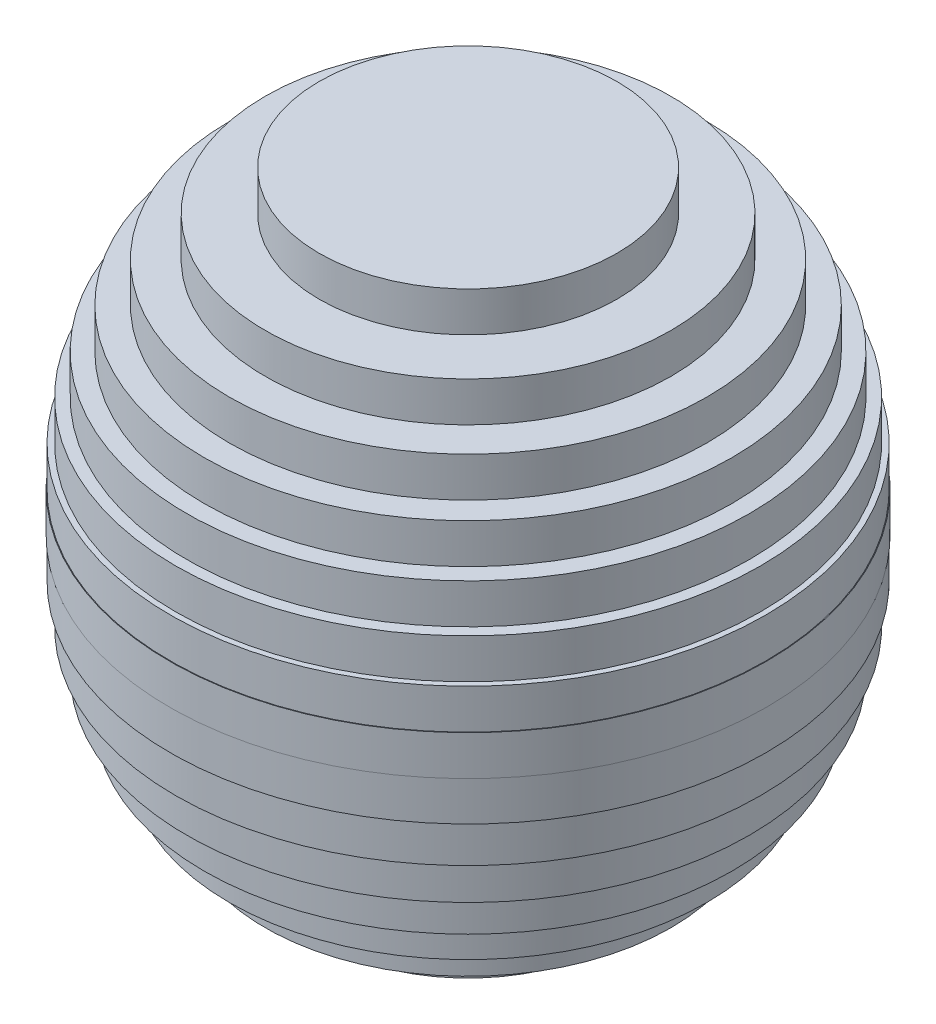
ISO-10303-21;
HEADER;
FILE_DESCRIPTION(('STEP AP214'),'2;1');
FILE_NAME('part.step','',(''),(''),'','','');
FILE_SCHEMA(('AUTOMOTIVE_DESIGN { 1 0 10303 214 1 1 1 1 }'));
ENDSEC;
DATA;
#1=APPLICATION_CONTEXT('core data for automotive mechanical design processes');
#2=APPLICATION_PROTOCOL_DEFINITION('international standard','automotive_design',2000,#1);
#3=PRODUCT_CONTEXT('',#1,'mechanical');
#4=PRODUCT('Part','Part','',(#3));
#5=PRODUCT_RELATED_PRODUCT_CATEGORY('part','',(#4));
#6=PRODUCT_DEFINITION_FORMATION('','',#4);
#7=PRODUCT_DEFINITION_CONTEXT('part definition',#1,'design');
#8=PRODUCT_DEFINITION('design','',#6,#7);
#9=PRODUCT_DEFINITION_SHAPE('','',#8);
#10=(LENGTH_UNIT() NAMED_UNIT(*) SI_UNIT(.MILLI.,.METRE.));
#11=(NAMED_UNIT(*) PLANE_ANGLE_UNIT() SI_UNIT($,.RADIAN.));
#12=(NAMED_UNIT(*) SI_UNIT($,.STERADIAN.) SOLID_ANGLE_UNIT());
#13=UNCERTAINTY_MEASURE_WITH_UNIT(LENGTH_MEASURE(1.E-05),#10,'distance_accuracy_value','');
#14=(GEOMETRIC_REPRESENTATION_CONTEXT(3) GLOBAL_UNCERTAINTY_ASSIGNED_CONTEXT((#13)) GLOBAL_UNIT_ASSIGNED_CONTEXT((#10,
#11,#12)) REPRESENTATION_CONTEXT('',''));
#15=CARTESIAN_POINT('',(0.,0.,0.));
#16=DIRECTION('',(0.,0.,1.));
#17=DIRECTION('',(1.,0.,0.));
#18=AXIS2_PLACEMENT_3D('',#15,#16,#17);
#19=CARTESIAN_POINT('',(37.4165738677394,2.49999999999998,0.));
#20=DIRECTION('',(0.,1.,0.));
#21=DIRECTION('',(-1.,0.,0.));
#22=AXIS2_PLACEMENT_3D('',#19,#20,#21);
#23=PLANE('',#22);
#24=CARTESIAN_POINT('',(0.,2.49999999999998,0.));
#25=DIRECTION('',(0.,-1.,0.));
#26=DIRECTION('',(1.,0.,0.));
#27=AXIS2_PLACEMENT_3D('',#24,#25,#26);
#28=CIRCLE('',#27,37.4165738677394);
#29=CARTESIAN_POINT('',(37.4165738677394,2.49999999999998,0.));
#30=VERTEX_POINT('',#29);
#31=EDGE_CURVE('E124',#30,#30,#28,.T.);
#32=ORIENTED_EDGE('',*,*,#31,.T.);
#33=EDGE_LOOP('',(#32));
#34=FACE_BOUND('',#33,.T.);
#35=CARTESIAN_POINT('',(0.,2.49999999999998,0.));
#36=DIRECTION('',(0.,-1.,0.));
#37=DIRECTION('',(1.,0.,0.));
#38=AXIS2_PLACEMENT_3D('',#35,#36,#37);
#39=CIRCLE('',#38,37.4999999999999);
#40=CARTESIAN_POINT('',(37.4999999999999,2.49999999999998,0.));
#41=VERTEX_POINT('',#40);
#42=EDGE_CURVE('E10',#41,#41,#39,.T.);
#43=ORIENTED_EDGE('',*,*,#42,.F.);
#44=EDGE_LOOP('',(#43));
#45=FACE_BOUND('',#44,.T.);
#46=ADVANCED_FACE('F30',(#34,#45),#23,.T.);
#47=CARTESIAN_POINT('',(0.,-37.5,0.));
#48=DIRECTION('',(0.,-1.,0.));
#49=DIRECTION('',(1.,0.,0.));
#50=AXIS2_PLACEMENT_3D('',#47,#48,#49);
#51=CYLINDRICAL_SURFACE('',#50,37.4999999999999);
#52=ORIENTED_EDGE('',*,*,#42,.T.);
#53=EDGE_LOOP('',(#52));
#54=FACE_BOUND('',#53,.T.);
#55=CARTESIAN_POINT('',(0.,-2.50000000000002,0.));
#56=DIRECTION('',(0.,-1.,0.));
#57=DIRECTION('',(1.,0.,0.));
#58=AXIS2_PLACEMENT_3D('',#55,#56,#57);
#59=CIRCLE('',#58,37.4999999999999);
#60=CARTESIAN_POINT('',(37.4999999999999,-2.50000000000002,0.));
#61=VERTEX_POINT('',#60);
#62=EDGE_CURVE('E36',#61,#61,#59,.T.);
#63=ORIENTED_EDGE('',*,*,#62,.F.);
#64=EDGE_LOOP('',(#63));
#65=FACE_BOUND('',#64,.T.);
#66=ADVANCED_FACE('F142',(#54,#65),#51,.T.);
#67=CARTESIAN_POINT('',(37.4999999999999,-2.50000000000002,0.));
#68=DIRECTION('',(0.,-1.,0.));
#69=DIRECTION('',(1.,0.,0.));
#70=AXIS2_PLACEMENT_3D('',#67,#68,#69);
#71=PLANE('',#70);
#72=ORIENTED_EDGE('',*,*,#62,.T.);
#73=EDGE_LOOP('',(#72));
#74=FACE_BOUND('',#73,.T.);
#75=CARTESIAN_POINT('',(0.,-2.50000000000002,0.));
#76=DIRECTION('',(0.,-1.,0.));
#77=DIRECTION('',(1.,0.,0.));
#78=AXIS2_PLACEMENT_3D('',#75,#76,#77);
#79=CIRCLE('',#78,37.4165738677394);
#80=CARTESIAN_POINT('',(37.4165738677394,-2.50000000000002,0.));
#81=VERTEX_POINT('',#80);
#82=EDGE_CURVE('E40',#81,#81,#79,.T.);
#83=ORIENTED_EDGE('',*,*,#82,.F.);
#84=EDGE_LOOP('',(#83));
#85=FACE_BOUND('',#84,.T.);
#86=ADVANCED_FACE('F146',(#74,#85),#71,.T.);
#87=CARTESIAN_POINT('',(0.,-37.5,0.));
#88=DIRECTION('',(0.,-1.,0.));
#89=DIRECTION('',(1.,0.,0.));
#90=AXIS2_PLACEMENT_3D('',#87,#88,#89);
#91=CYLINDRICAL_SURFACE('',#90,37.4165738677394);
#92=ORIENTED_EDGE('',*,*,#82,.T.);
#93=EDGE_LOOP('',(#92));
#94=FACE_BOUND('',#93,.T.);
#95=CARTESIAN_POINT('',(0.,-7.50000000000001,0.));
#96=DIRECTION('',(0.,-1.,0.));
#97=DIRECTION('',(1.,0.,0.));
#98=AXIS2_PLACEMENT_3D('',#95,#96,#97);
#99=CIRCLE('',#98,37.4165738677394);
#100=CARTESIAN_POINT('',(37.4165738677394,-7.50000000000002,0.));
#101=VERTEX_POINT('',#100);
#102=EDGE_CURVE('E44',#101,#101,#99,.T.);
#103=ORIENTED_EDGE('',*,*,#102,.F.);
#104=EDGE_LOOP('',(#103));
#105=FACE_BOUND('',#104,.T.);
#106=ADVANCED_FACE('F150',(#94,#105),#91,.T.);
#107=CARTESIAN_POINT('',(37.4165738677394,-7.50000000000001,0.));
#108=DIRECTION('',(0.,-1.,0.));
#109=DIRECTION('',(1.,0.,0.));
#110=AXIS2_PLACEMENT_3D('',#107,#108,#109);
#111=PLANE('',#110);
#112=ORIENTED_EDGE('',*,*,#102,.T.);
#113=EDGE_LOOP('',(#112));
#114=FACE_BOUND('',#113,.T.);
#115=CARTESIAN_POINT('',(0.,-7.50000000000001,0.));
#116=DIRECTION('',(0.,-1.,0.));
#117=DIRECTION('',(1.,0.,0.));
#118=AXIS2_PLACEMENT_3D('',#115,#116,#117);
#119=CIRCLE('',#118,36.7423461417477);
#120=CARTESIAN_POINT('',(36.7423461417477,-7.50000000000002,0.));
#121=VERTEX_POINT('',#120);
#122=EDGE_CURVE('E49',#121,#121,#119,.T.);
#123=ORIENTED_EDGE('',*,*,#122,.F.);
#124=EDGE_LOOP('',(#123));
#125=FACE_BOUND('',#124,.T.);
#126=ADVANCED_FACE('F156',(#114,#125),#111,.T.);
#127=CARTESIAN_POINT('',(0.,-37.5,0.));
#128=DIRECTION('',(0.,-1.,0.));
#129=DIRECTION('',(1.,0.,0.));
#130=AXIS2_PLACEMENT_3D('',#127,#128,#129);
#131=CYLINDRICAL_SURFACE('',#130,36.7423461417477);
#132=ORIENTED_EDGE('',*,*,#122,.T.);
#133=EDGE_LOOP('',(#132));
#134=FACE_BOUND('',#133,.T.);
#135=CARTESIAN_POINT('',(0.,-12.5,0.));
#136=DIRECTION('',(0.,-1.,0.));
#137=DIRECTION('',(1.,0.,0.));
#138=AXIS2_PLACEMENT_3D('',#135,#136,#137);
#139=CIRCLE('',#138,36.7423461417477);
#140=CARTESIAN_POINT('',(36.7423461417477,-12.5,0.));
#141=VERTEX_POINT('',#140);
#142=EDGE_CURVE('E52',#141,#141,#139,.T.);
#143=ORIENTED_EDGE('',*,*,#142,.F.);
#144=EDGE_LOOP('',(#143));
#145=FACE_BOUND('',#144,.T.);
#146=ADVANCED_FACE('F160',(#134,#145),#131,.T.);
#147=CARTESIAN_POINT('',(36.7423461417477,-12.5,0.));
#148=DIRECTION('',(0.,-1.,0.));
#149=DIRECTION('',(1.,0.,0.));
#150=AXIS2_PLACEMENT_3D('',#147,#148,#149);
#151=PLANE('',#150);
#152=ORIENTED_EDGE('',*,*,#142,.T.);
#153=EDGE_LOOP('',(#152));
#154=FACE_BOUND('',#153,.T.);
#155=CARTESIAN_POINT('',(0.,-12.5,0.));
#156=DIRECTION('',(0.,-1.,0.));
#157=DIRECTION('',(1.,0.,0.));
#158=AXIS2_PLACEMENT_3D('',#155,#156,#157);
#159=CIRCLE('',#158,35.3553390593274);
#160=CARTESIAN_POINT('',(35.3553390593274,-12.5,0.));
#161=VERTEX_POINT('',#160);
#162=EDGE_CURVE('E55',#161,#161,#159,.T.);
#163=ORIENTED_EDGE('',*,*,#162,.F.);
#164=EDGE_LOOP('',(#163));
#165=FACE_BOUND('',#164,.T.);
#166=ADVANCED_FACE('F164',(#154,#165),#151,.T.);
#167=CARTESIAN_POINT('',(0.,-37.5,0.));
#168=DIRECTION('',(0.,-1.,0.));
#169=DIRECTION('',(1.,0.,0.));
#170=AXIS2_PLACEMENT_3D('',#167,#168,#169);
#171=CYLINDRICAL_SURFACE('',#170,35.3553390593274);
#172=ORIENTED_EDGE('',*,*,#162,.T.);
#173=EDGE_LOOP('',(#172));
#174=FACE_BOUND('',#173,.T.);
#175=CARTESIAN_POINT('',(0.,-17.5,0.));
#176=DIRECTION('',(0.,-1.,0.));
#177=DIRECTION('',(1.,0.,0.));
#178=AXIS2_PLACEMENT_3D('',#175,#176,#177);
#179=CIRCLE('',#178,35.3553390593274);
#180=CARTESIAN_POINT('',(35.3553390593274,-17.5,0.));
#181=VERTEX_POINT('',#180);
#182=EDGE_CURVE('E58',#181,#181,#179,.T.);
#183=ORIENTED_EDGE('',*,*,#182,.F.);
#184=EDGE_LOOP('',(#183));
#185=FACE_BOUND('',#184,.T.);
#186=ADVANCED_FACE('F168',(#174,#185),#171,.T.);
#187=CARTESIAN_POINT('',(35.3553390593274,-17.5,0.));
#188=DIRECTION('',(0.,-1.,0.));
#189=DIRECTION('',(1.,0.,0.));
#190=AXIS2_PLACEMENT_3D('',#187,#188,#189);
#191=PLANE('',#190);
#192=ORIENTED_EDGE('',*,*,#182,.T.);
#193=EDGE_LOOP('',(#192));
#194=FACE_BOUND('',#193,.T.);
#195=CARTESIAN_POINT('',(0.,-17.5,0.));
#196=DIRECTION('',(0.,-1.,0.));
#197=DIRECTION('',(1.,0.,0.));
#198=AXIS2_PLACEMENT_3D('',#195,#196,#197);
#199=CIRCLE('',#198,33.166247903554);
#200=CARTESIAN_POINT('',(33.166247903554,-17.5,0.));
#201=VERTEX_POINT('',#200);
#202=EDGE_CURVE('E61',#201,#201,#199,.T.);
#203=ORIENTED_EDGE('',*,*,#202,.F.);
#204=EDGE_LOOP('',(#203));
#205=FACE_BOUND('',#204,.T.);
#206=ADVANCED_FACE('F172',(#194,#205),#191,.T.);
#207=CARTESIAN_POINT('',(0.,-37.5,0.));
#208=DIRECTION('',(0.,-1.,0.));
#209=DIRECTION('',(1.,0.,0.));
#210=AXIS2_PLACEMENT_3D('',#207,#208,#209);
#211=CYLINDRICAL_SURFACE('',#210,33.166247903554);
#212=ORIENTED_EDGE('',*,*,#202,.T.);
#213=EDGE_LOOP('',(#212));
#214=FACE_BOUND('',#213,.T.);
#215=CARTESIAN_POINT('',(0.,-22.5,0.));
#216=DIRECTION('',(0.,-1.,0.));
#217=DIRECTION('',(1.,0.,0.));
#218=AXIS2_PLACEMENT_3D('',#215,#216,#217);
#219=CIRCLE('',#218,33.166247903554);
#220=CARTESIAN_POINT('',(33.166247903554,-22.5,0.));
#221=VERTEX_POINT('',#220);
#222=EDGE_CURVE('E64',#221,#221,#219,.T.);
#223=ORIENTED_EDGE('',*,*,#222,.F.);
#224=EDGE_LOOP('',(#223));
#225=FACE_BOUND('',#224,.T.);
#226=ADVANCED_FACE('F176',(#214,#225),#211,.T.);
#227=CARTESIAN_POINT('',(33.166247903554,-22.5,0.));
#228=DIRECTION('',(0.,-1.,0.));
#229=DIRECTION('',(1.,0.,0.));
#230=AXIS2_PLACEMENT_3D('',#227,#228,#229);
#231=PLANE('',#230);
#232=ORIENTED_EDGE('',*,*,#222,.T.);
#233=EDGE_LOOP('',(#232));
#234=FACE_BOUND('',#233,.T.);
#235=CARTESIAN_POINT('',(0.,-22.5,0.));
#236=DIRECTION('',(0.,-1.,0.));
#237=DIRECTION('',(1.,0.,0.));
#238=AXIS2_PLACEMENT_3D('',#235,#236,#237);
#239=CIRCLE('',#238,30.);
#240=CARTESIAN_POINT('',(30.,-22.5,0.));
#241=VERTEX_POINT('',#240);
#242=EDGE_CURVE('E67',#241,#241,#239,.T.);
#243=ORIENTED_EDGE('',*,*,#242,.F.);
#244=EDGE_LOOP('',(#243));
#245=FACE_BOUND('',#244,.T.);
#246=ADVANCED_FACE('F180',(#234,#245),#231,.T.);
#247=CARTESIAN_POINT('',(0.,-37.5,0.));
#248=DIRECTION('',(0.,-1.,0.));
#249=DIRECTION('',(1.,0.,0.));
#250=AXIS2_PLACEMENT_3D('',#247,#248,#249);
#251=CYLINDRICAL_SURFACE('',#250,30.);
#252=ORIENTED_EDGE('',*,*,#242,.T.);
#253=EDGE_LOOP('',(#252));
#254=FACE_BOUND('',#253,.T.);
#255=CARTESIAN_POINT('',(0.,-27.5,0.));
#256=DIRECTION('',(0.,-1.,0.));
#257=DIRECTION('',(1.,0.,0.));
#258=AXIS2_PLACEMENT_3D('',#255,#256,#257);
#259=CIRCLE('',#258,30.);
#260=CARTESIAN_POINT('',(30.,-27.5,0.));
#261=VERTEX_POINT('',#260);
#262=EDGE_CURVE('E70',#261,#261,#259,.T.);
#263=ORIENTED_EDGE('',*,*,#262,.F.);
#264=EDGE_LOOP('',(#263));
#265=FACE_BOUND('',#264,.T.);
#266=ADVANCED_FACE('F184',(#254,#265),#251,.T.);
#267=CARTESIAN_POINT('',(30.,-27.5,0.));
#268=DIRECTION('',(0.,-1.,0.));
#269=DIRECTION('',(1.,0.,0.));
#270=AXIS2_PLACEMENT_3D('',#267,#268,#269);
#271=PLANE('',#270);
#272=ORIENTED_EDGE('',*,*,#262,.T.);
#273=EDGE_LOOP('',(#272));
#274=FACE_BOUND('',#273,.T.);
#275=CARTESIAN_POINT('',(0.,-27.5,0.));
#276=DIRECTION('',(0.,-1.,0.));
#277=DIRECTION('',(1.,0.,0.));
#278=AXIS2_PLACEMENT_3D('',#275,#276,#277);
#279=CIRCLE('',#278,25.4950975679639);
#280=CARTESIAN_POINT('',(25.4950975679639,-27.5,0.));
#281=VERTEX_POINT('',#280);
#282=EDGE_CURVE('E73',#281,#281,#279,.T.);
#283=ORIENTED_EDGE('',*,*,#282,.F.);
#284=EDGE_LOOP('',(#283));
#285=FACE_BOUND('',#284,.T.);
#286=ADVANCED_FACE('F188',(#274,#285),#271,.T.);
#287=CARTESIAN_POINT('',(0.,-37.5,0.));
#288=DIRECTION('',(0.,-1.,0.));
#289=DIRECTION('',(1.,0.,0.));
#290=AXIS2_PLACEMENT_3D('',#287,#288,#289);
#291=CYLINDRICAL_SURFACE('',#290,25.4950975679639);
#292=ORIENTED_EDGE('',*,*,#282,.T.);
#293=EDGE_LOOP('',(#292));
#294=FACE_BOUND('',#293,.T.);
#295=CARTESIAN_POINT('',(0.,-32.5,0.));
#296=DIRECTION('',(0.,-1.,0.));
#297=DIRECTION('',(1.,0.,0.));
#298=AXIS2_PLACEMENT_3D('',#295,#296,#297);
#299=CIRCLE('',#298,25.4950975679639);
#300=CARTESIAN_POINT('',(25.4950975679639,-32.5,0.));
#301=VERTEX_POINT('',#300);
#302=EDGE_CURVE('E76',#301,#301,#299,.T.);
#303=ORIENTED_EDGE('',*,*,#302,.F.);
#304=EDGE_LOOP('',(#303));
#305=FACE_BOUND('',#304,.T.);
#306=ADVANCED_FACE('F192',(#294,#305),#291,.T.);
#307=CARTESIAN_POINT('',(25.4950975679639,-32.5,0.));
#308=DIRECTION('',(0.,-1.,0.));
#309=DIRECTION('',(1.,0.,0.));
#310=AXIS2_PLACEMENT_3D('',#307,#308,#309);
#311=PLANE('',#310);
#312=ORIENTED_EDGE('',*,*,#302,.T.);
#313=EDGE_LOOP('',(#312));
#314=FACE_BOUND('',#313,.T.);
#315=CARTESIAN_POINT('',(0.,-32.5,0.));
#316=DIRECTION('',(0.,-1.,0.));
#317=DIRECTION('',(1.,0.,0.));
#318=AXIS2_PLACEMENT_3D('',#315,#316,#317);
#319=CIRCLE('',#318,18.7082869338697);
#320=CARTESIAN_POINT('',(18.7082869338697,-32.5,0.));
#321=VERTEX_POINT('',#320);
#322=EDGE_CURVE('E79',#321,#321,#319,.T.);
#323=ORIENTED_EDGE('',*,*,#322,.F.);
#324=EDGE_LOOP('',(#323));
#325=FACE_BOUND('',#324,.T.);
#326=ADVANCED_FACE('F196',(#314,#325),#311,.T.);
#327=CARTESIAN_POINT('',(0.,-37.5,0.));
#328=DIRECTION('',(0.,-1.,0.));
#329=DIRECTION('',(1.,0.,0.));
#330=AXIS2_PLACEMENT_3D('',#327,#328,#329);
#331=CYLINDRICAL_SURFACE('',#330,18.7082869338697);
#332=ORIENTED_EDGE('',*,*,#322,.T.);
#333=EDGE_LOOP('',(#332));
#334=FACE_BOUND('',#333,.T.);
#335=CARTESIAN_POINT('',(0.,-37.5,0.));
#336=DIRECTION('',(0.,-1.,0.));
#337=DIRECTION('',(1.,0.,0.));
#338=AXIS2_PLACEMENT_3D('',#335,#336,#337);
#339=CIRCLE('',#338,18.7082869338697);
#340=CARTESIAN_POINT('',(18.7082869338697,-37.5,0.));
#341=VERTEX_POINT('',#340);
#342=EDGE_CURVE('E82',#341,#341,#339,.T.);
#343=ORIENTED_EDGE('',*,*,#342,.F.);
#344=EDGE_LOOP('',(#343));
#345=FACE_BOUND('',#344,.T.);
#346=ADVANCED_FACE('F200',(#334,#345),#331,.T.);
#347=CARTESIAN_POINT('',(18.7082869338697,-37.5,0.));
#348=DIRECTION('',(0.,-1.,0.));
#349=DIRECTION('',(1.,0.,0.));
#350=AXIS2_PLACEMENT_3D('',#347,#348,#349);
#351=PLANE('',#350);
#352=ORIENTED_EDGE('',*,*,#342,.T.);
#353=EDGE_LOOP('',(#352));
#354=FACE_BOUND('',#353,.T.);
#355=ADVANCED_FACE('F204',(#354),#351,.T.);
#356=CARTESIAN_POINT('',(18.7082869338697,37.5,0.));
#357=DIRECTION('',(0.,1.,0.));
#358=DIRECTION('',(-1.,0.,0.));
#359=AXIS2_PLACEMENT_3D('',#356,#357,#358);
#360=PLANE('',#359);
#361=CARTESIAN_POINT('',(0.,37.5,0.));
#362=DIRECTION('',(0.,-1.,0.));
#363=DIRECTION('',(1.,0.,0.));
#364=AXIS2_PLACEMENT_3D('',#361,#362,#363);
#365=CIRCLE('',#364,18.7082869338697);
#366=CARTESIAN_POINT('',(18.7082869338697,37.5,0.));
#367=VERTEX_POINT('',#366);
#368=EDGE_CURVE('E85',#367,#367,#365,.T.);
#369=ORIENTED_EDGE('',*,*,#368,.F.);
#370=EDGE_LOOP('',(#369));
#371=FACE_BOUND('',#370,.T.);
#372=ADVANCED_FACE('F208',(#371),#360,.T.);
#373=CARTESIAN_POINT('',(0.,-37.5,0.));
#374=DIRECTION('',(0.,-1.,0.));
#375=DIRECTION('',(1.,0.,0.));
#376=AXIS2_PLACEMENT_3D('',#373,#374,#375);
#377=CYLINDRICAL_SURFACE('',#376,18.7082869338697);
#378=ORIENTED_EDGE('',*,*,#368,.T.);
#379=EDGE_LOOP('',(#378));
#380=FACE_BOUND('',#379,.T.);
#381=CARTESIAN_POINT('',(0.,32.5,0.));
#382=DIRECTION('',(0.,-1.,0.));
#383=DIRECTION('',(1.,0.,0.));
#384=AXIS2_PLACEMENT_3D('',#381,#382,#383);
#385=CIRCLE('',#384,18.7082869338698);
#386=CARTESIAN_POINT('',(18.7082869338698,32.5,0.));
#387=VERTEX_POINT('',#386);
#388=EDGE_CURVE('E88',#387,#387,#385,.T.);
#389=ORIENTED_EDGE('',*,*,#388,.F.);
#390=EDGE_LOOP('',(#389));
#391=FACE_BOUND('',#390,.T.);
#392=ADVANCED_FACE('F212',(#380,#391),#377,.T.);
#393=CARTESIAN_POINT('',(18.7082869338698,32.5,0.));
#394=DIRECTION('',(0.,1.,0.));
#395=DIRECTION('',(-1.,0.,0.));
#396=AXIS2_PLACEMENT_3D('',#393,#394,#395);
#397=PLANE('',#396);
#398=ORIENTED_EDGE('',*,*,#388,.T.);
#399=EDGE_LOOP('',(#398));
#400=FACE_BOUND('',#399,.T.);
#401=CARTESIAN_POINT('',(0.,32.5,0.));
#402=DIRECTION('',(0.,-1.,0.));
#403=DIRECTION('',(1.,0.,0.));
#404=AXIS2_PLACEMENT_3D('',#401,#402,#403);
#405=CIRCLE('',#404,25.4950975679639);
#406=CARTESIAN_POINT('',(25.4950975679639,32.5,0.));
#407=VERTEX_POINT('',#406);
#408=EDGE_CURVE('E91',#407,#407,#405,.T.);
#409=ORIENTED_EDGE('',*,*,#408,.F.);
#410=EDGE_LOOP('',(#409));
#411=FACE_BOUND('',#410,.T.);
#412=ADVANCED_FACE('F216',(#400,#411),#397,.T.);
#413=CARTESIAN_POINT('',(0.,-37.5,0.));
#414=DIRECTION('',(0.,-1.,0.));
#415=DIRECTION('',(1.,0.,0.));
#416=AXIS2_PLACEMENT_3D('',#413,#414,#415);
#417=CYLINDRICAL_SURFACE('',#416,25.4950975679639);
#418=ORIENTED_EDGE('',*,*,#408,.T.);
#419=EDGE_LOOP('',(#418));
#420=FACE_BOUND('',#419,.T.);
#421=CARTESIAN_POINT('',(0.,27.5,0.));
#422=DIRECTION('',(0.,-1.,0.));
#423=DIRECTION('',(1.,0.,0.));
#424=AXIS2_PLACEMENT_3D('',#421,#422,#423);
#425=CIRCLE('',#424,25.4950975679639);
#426=CARTESIAN_POINT('',(25.4950975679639,27.5,0.));
#427=VERTEX_POINT('',#426);
#428=EDGE_CURVE('E94',#427,#427,#425,.T.);
#429=ORIENTED_EDGE('',*,*,#428,.F.);
#430=EDGE_LOOP('',(#429));
#431=FACE_BOUND('',#430,.T.);
#432=ADVANCED_FACE('F220',(#420,#431),#417,.T.);
#433=CARTESIAN_POINT('',(25.4950975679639,27.5,0.));
#434=DIRECTION('',(0.,1.,0.));
#435=DIRECTION('',(-1.,0.,0.));
#436=AXIS2_PLACEMENT_3D('',#433,#434,#435);
#437=PLANE('',#436);
#438=ORIENTED_EDGE('',*,*,#428,.T.);
#439=EDGE_LOOP('',(#438));
#440=FACE_BOUND('',#439,.T.);
#441=CARTESIAN_POINT('',(0.,27.5,0.));
#442=DIRECTION('',(0.,-1.,0.));
#443=DIRECTION('',(1.,0.,0.));
#444=AXIS2_PLACEMENT_3D('',#441,#442,#443);
#445=CIRCLE('',#444,30.);
#446=CARTESIAN_POINT('',(30.,27.5,0.));
#447=VERTEX_POINT('',#446);
#448=EDGE_CURVE('E97',#447,#447,#445,.T.);
#449=ORIENTED_EDGE('',*,*,#448,.F.);
#450=EDGE_LOOP('',(#449));
#451=FACE_BOUND('',#450,.T.);
#452=ADVANCED_FACE('F224',(#440,#451),#437,.T.);
#453=CARTESIAN_POINT('',(0.,-37.5,0.));
#454=DIRECTION('',(0.,-1.,0.));
#455=DIRECTION('',(1.,0.,0.));
#456=AXIS2_PLACEMENT_3D('',#453,#454,#455);
#457=CYLINDRICAL_SURFACE('',#456,30.);
#458=ORIENTED_EDGE('',*,*,#448,.T.);
#459=EDGE_LOOP('',(#458));
#460=FACE_BOUND('',#459,.T.);
#461=CARTESIAN_POINT('',(0.,22.5,0.));
#462=DIRECTION('',(0.,-1.,0.));
#463=DIRECTION('',(1.,0.,0.));
#464=AXIS2_PLACEMENT_3D('',#461,#462,#463);
#465=CIRCLE('',#464,30.);
#466=CARTESIAN_POINT('',(30.,22.5,0.));
#467=VERTEX_POINT('',#466);
#468=EDGE_CURVE('E100',#467,#467,#465,.T.);
#469=ORIENTED_EDGE('',*,*,#468,.F.);
#470=EDGE_LOOP('',(#469));
#471=FACE_BOUND('',#470,.T.);
#472=ADVANCED_FACE('F228',(#460,#471),#457,.T.);
#473=CARTESIAN_POINT('',(30.,22.5,0.));
#474=DIRECTION('',(0.,1.,0.));
#475=DIRECTION('',(-1.,0.,0.));
#476=AXIS2_PLACEMENT_3D('',#473,#474,#475);
#477=PLANE('',#476);
#478=ORIENTED_EDGE('',*,*,#468,.T.);
#479=EDGE_LOOP('',(#478));
#480=FACE_BOUND('',#479,.T.);
#481=CARTESIAN_POINT('',(0.,22.5,0.));
#482=DIRECTION('',(0.,-1.,0.));
#483=DIRECTION('',(1.,0.,0.));
#484=AXIS2_PLACEMENT_3D('',#481,#482,#483);
#485=CIRCLE('',#484,33.166247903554);
#486=CARTESIAN_POINT('',(33.166247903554,22.5,0.));
#487=VERTEX_POINT('',#486);
#488=EDGE_CURVE('E103',#487,#487,#485,.T.);
#489=ORIENTED_EDGE('',*,*,#488,.F.);
#490=EDGE_LOOP('',(#489));
#491=FACE_BOUND('',#490,.T.);
#492=ADVANCED_FACE('F232',(#480,#491),#477,.T.);
#493=CARTESIAN_POINT('',(0.,-37.5,0.));
#494=DIRECTION('',(0.,-1.,0.));
#495=DIRECTION('',(1.,0.,0.));
#496=AXIS2_PLACEMENT_3D('',#493,#494,#495);
#497=CYLINDRICAL_SURFACE('',#496,33.166247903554);
#498=ORIENTED_EDGE('',*,*,#488,.T.);
#499=EDGE_LOOP('',(#498));
#500=FACE_BOUND('',#499,.T.);
#501=CARTESIAN_POINT('',(0.,17.5,0.));
#502=DIRECTION('',(0.,-1.,0.));
#503=DIRECTION('',(1.,0.,0.));
#504=AXIS2_PLACEMENT_3D('',#501,#502,#503);
#505=CIRCLE('',#504,33.166247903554);
#506=CARTESIAN_POINT('',(33.166247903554,17.5,0.));
#507=VERTEX_POINT('',#506);
#508=EDGE_CURVE('E106',#507,#507,#505,.T.);
#509=ORIENTED_EDGE('',*,*,#508,.F.);
#510=EDGE_LOOP('',(#509));
#511=FACE_BOUND('',#510,.T.);
#512=ADVANCED_FACE('F236',(#500,#511),#497,.T.);
#513=CARTESIAN_POINT('',(33.166247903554,17.5,0.));
#514=DIRECTION('',(0.,1.,0.));
#515=DIRECTION('',(-1.,0.,0.));
#516=AXIS2_PLACEMENT_3D('',#513,#514,#515);
#517=PLANE('',#516);
#518=ORIENTED_EDGE('',*,*,#508,.T.);
#519=EDGE_LOOP('',(#518));
#520=FACE_BOUND('',#519,.T.);
#521=CARTESIAN_POINT('',(0.,17.5,0.));
#522=DIRECTION('',(0.,-1.,0.));
#523=DIRECTION('',(1.,0.,0.));
#524=AXIS2_PLACEMENT_3D('',#521,#522,#523);
#525=CIRCLE('',#524,35.3553390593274);
#526=CARTESIAN_POINT('',(35.3553390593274,17.5,0.));
#527=VERTEX_POINT('',#526);
#528=EDGE_CURVE('E109',#527,#527,#525,.T.);
#529=ORIENTED_EDGE('',*,*,#528,.F.);
#530=EDGE_LOOP('',(#529));
#531=FACE_BOUND('',#530,.T.);
#532=ADVANCED_FACE('F240',(#520,#531),#517,.T.);
#533=CARTESIAN_POINT('',(0.,-37.5,0.));
#534=DIRECTION('',(0.,-1.,0.));
#535=DIRECTION('',(1.,0.,0.));
#536=AXIS2_PLACEMENT_3D('',#533,#534,#535);
#537=CYLINDRICAL_SURFACE('',#536,35.3553390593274);
#538=ORIENTED_EDGE('',*,*,#528,.T.);
#539=EDGE_LOOP('',(#538));
#540=FACE_BOUND('',#539,.T.);
#541=CARTESIAN_POINT('',(0.,12.5,0.));
#542=DIRECTION('',(0.,-1.,0.));
#543=DIRECTION('',(1.,0.,0.));
#544=AXIS2_PLACEMENT_3D('',#541,#542,#543);
#545=CIRCLE('',#544,35.3553390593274);
#546=CARTESIAN_POINT('',(35.3553390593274,12.5,0.));
#547=VERTEX_POINT('',#546);
#548=EDGE_CURVE('E112',#547,#547,#545,.T.);
#549=ORIENTED_EDGE('',*,*,#548,.F.);
#550=EDGE_LOOP('',(#549));
#551=FACE_BOUND('',#550,.T.);
#552=ADVANCED_FACE('F244',(#540,#551),#537,.T.);
#553=CARTESIAN_POINT('',(35.3553390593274,12.5,0.));
#554=DIRECTION('',(0.,1.,0.));
#555=DIRECTION('',(-1.,0.,0.));
#556=AXIS2_PLACEMENT_3D('',#553,#554,#555);
#557=PLANE('',#556);
#558=ORIENTED_EDGE('',*,*,#548,.T.);
#559=EDGE_LOOP('',(#558));
#560=FACE_BOUND('',#559,.T.);
#561=CARTESIAN_POINT('',(0.,12.5,0.));
#562=DIRECTION('',(0.,-1.,0.));
#563=DIRECTION('',(1.,0.,0.));
#564=AXIS2_PLACEMENT_3D('',#561,#562,#563);
#565=CIRCLE('',#564,36.7423461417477);
#566=CARTESIAN_POINT('',(36.7423461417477,12.5,0.));
#567=VERTEX_POINT('',#566);
#568=EDGE_CURVE('E115',#567,#567,#565,.T.);
#569=ORIENTED_EDGE('',*,*,#568,.F.);
#570=EDGE_LOOP('',(#569));
#571=FACE_BOUND('',#570,.T.);
#572=ADVANCED_FACE('F248',(#560,#571),#557,.T.);
#573=CARTESIAN_POINT('',(0.,-37.5,0.));
#574=DIRECTION('',(0.,-1.,0.));
#575=DIRECTION('',(1.,0.,0.));
#576=AXIS2_PLACEMENT_3D('',#573,#574,#575);
#577=CYLINDRICAL_SURFACE('',#576,36.7423461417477);
#578=ORIENTED_EDGE('',*,*,#568,.T.);
#579=EDGE_LOOP('',(#578));
#580=FACE_BOUND('',#579,.T.);
#581=CARTESIAN_POINT('',(0.,7.49999999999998,0.));
#582=DIRECTION('',(0.,-1.,0.));
#583=DIRECTION('',(1.,0.,0.));
#584=AXIS2_PLACEMENT_3D('',#581,#582,#583);
#585=CIRCLE('',#584,36.7423461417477);
#586=CARTESIAN_POINT('',(36.7423461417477,7.49999999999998,0.));
#587=VERTEX_POINT('',#586);
#588=EDGE_CURVE('E118',#587,#587,#585,.T.);
#589=ORIENTED_EDGE('',*,*,#588,.F.);
#590=EDGE_LOOP('',(#589));
#591=FACE_BOUND('',#590,.T.);
#592=ADVANCED_FACE('F138',(#580,#591),#577,.T.);
#593=CARTESIAN_POINT('',(36.7423461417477,7.49999999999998,0.));
#594=DIRECTION('',(0.,1.,0.));
#595=DIRECTION('',(-1.,0.,0.));
#596=AXIS2_PLACEMENT_3D('',#593,#594,#595);
#597=PLANE('',#596);
#598=ORIENTED_EDGE('',*,*,#588,.T.);
#599=EDGE_LOOP('',(#598));
#600=FACE_BOUND('',#599,.T.);
#601=CARTESIAN_POINT('',(0.,7.49999999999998,0.));
#602=DIRECTION('',(0.,-1.,0.));
#603=DIRECTION('',(1.,0.,0.));
#604=AXIS2_PLACEMENT_3D('',#601,#602,#603);
#605=CIRCLE('',#604,37.4165738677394);
#606=CARTESIAN_POINT('',(37.4165738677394,7.49999999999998,0.));
#607=VERTEX_POINT('',#606);
#608=EDGE_CURVE('E121',#607,#607,#605,.T.);
#609=ORIENTED_EDGE('',*,*,#608,.F.);
#610=EDGE_LOOP('',(#609));
#611=FACE_BOUND('',#610,.T.);
#612=ADVANCED_FACE('F132',(#600,#611),#597,.T.);
#613=CARTESIAN_POINT('',(0.,-37.5,0.));
#614=DIRECTION('',(0.,-1.,0.));
#615=DIRECTION('',(1.,0.,0.));
#616=AXIS2_PLACEMENT_3D('',#613,#614,#615);
#617=CYLINDRICAL_SURFACE('',#616,37.4165738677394);
#618=ORIENTED_EDGE('',*,*,#608,.T.);
#619=EDGE_LOOP('',(#618));
#620=FACE_BOUND('',#619,.T.);
#621=ORIENTED_EDGE('',*,*,#31,.F.);
#622=EDGE_LOOP('',(#621));
#623=FACE_BOUND('',#622,.T.);
#624=ADVANCED_FACE('F130',(#620,#623),#617,.T.);
#625=CLOSED_SHELL('',(#46,#66,#86,#106,#126,#146,#166,#186,#206,#226,#246,#266,#286,#306,#326,
#346,#355,#372,#392,#412,#432,#452,#472,#492,#512,#532,#552,#572,#592,#612,#624));
#626=MANIFOLD_SOLID_BREP('B2',#625);
#627=ADVANCED_BREP_SHAPE_REPRESENTATION('',(#18,#626),#14);
#628=SHAPE_DEFINITION_REPRESENTATION(#9,#627);
ENDSEC;
END-ISO-10303-21;
